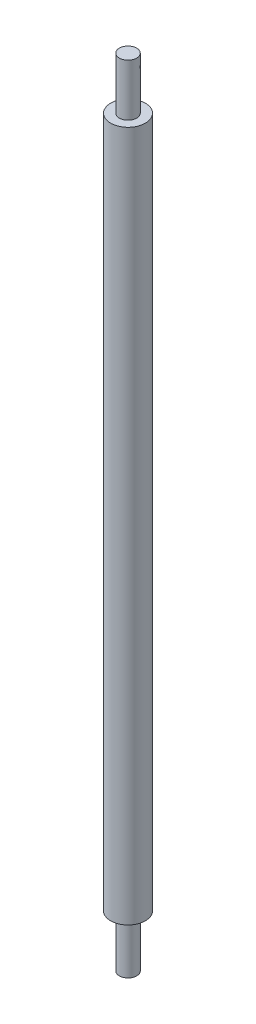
from build123d import *

# Parameters (mm, degrees)
SKETCH1_R      = 3
EXTRUDE1_DEPTH = 119.5
SKETCH2_R      = 1.5
EXTRUDE2_DEPTH = 9
EXTRUDE3_START = 9
SKETCH3_R      = 1.5
EXTRUDE3_DEPTH = 9


with BuildPart() as part:
    # Sketch1 → Extrude1 (new body)
    with BuildSketch(Plane(origin=(0, 0, 0), x_dir=(1, 0, 0), z_dir=(0, 1, 0))):
        with Locations(Location((0, 0, 0), (0, 0, 90))):
            Circle(SKETCH1_R)
    extrude(amount=EXTRUDE1_DEPTH)

    # Sketch2 → Extrude2 (add)
    with BuildSketch(Plane(origin=(0, 119.5, 0), x_dir=(1, 0, 0), z_dir=(0, 1, 0))):
        with Locations(Location((0, 0, 0), (0, 0, 270))):
            Circle(SKETCH2_R)
    extrude(amount=EXTRUDE2_DEPTH)

    # Sketch3 → Extrude3 (add)
    with BuildSketch(Plane.XZ.offset(EXTRUDE3_START)):
        with Locations(Location((0, 0, 0), (0, 0, 90))):
            Circle(SKETCH3_R)
    extrude(amount=-EXTRUDE3_DEPTH)


solid = part.part
